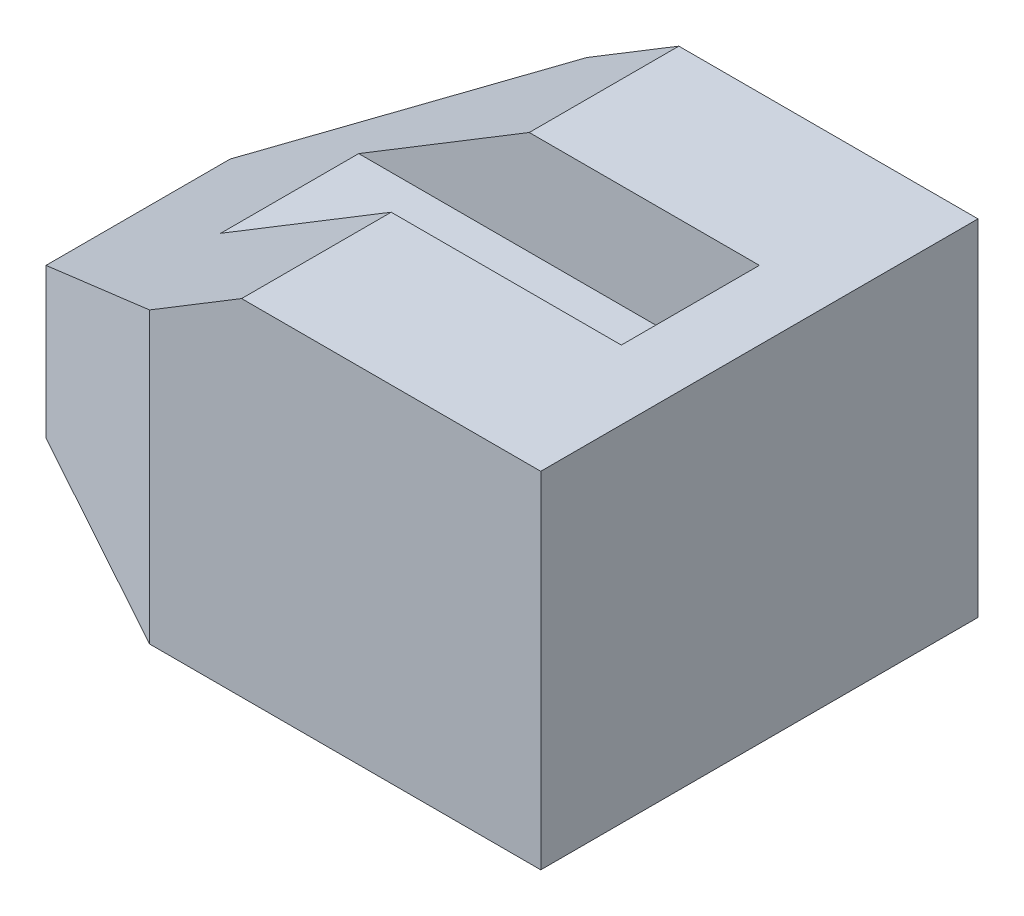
from build123d import *

# Parameters (mm, degrees)
EXTRUDE_1_DEPTH     = 19
CUT_EXTRUDE_1_DEPTH = 38
CUT_EXTRUDE_2_DEPTH = 6


with BuildPart() as part:
    # Sketch 1 → Extrude 1 (new, symmetric)
    with BuildSketch(Plane.XY):
        Polygon((0, 0), (54, 0), (54, 30), (28, 30), (0, 13), align=None)
    extrude(amount=EXTRUDE_1_DEPTH, both=True)

    # Sketch 2 → Cut-Extrude 1 (cut)
    with BuildSketch(Plane.XZ):
        Polygon((20, 19), (0, 8), (0, 19), align=None)
    cut_extrude_1 = extrude(amount=-CUT_EXTRUDE_1_DEPTH, mode=Mode.SUBTRACT)

    # Mirror 1: Cut-Extrude 1 across plane
    add(cut_extrude_1.mirror(Plane.XY), mode=Mode.SUBTRACT)

    # Sketch 4 → Cut-Extrude 2 (cut, symmetric)
    with BuildSketch(Plane.XY):
        Polygon((48, 30), (40.501443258, 21), (13.176470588, 21), (28, 30), align=None)
    extrude(amount=CUT_EXTRUDE_2_DEPTH, both=True, mode=Mode.SUBTRACT)


solid = part.part
